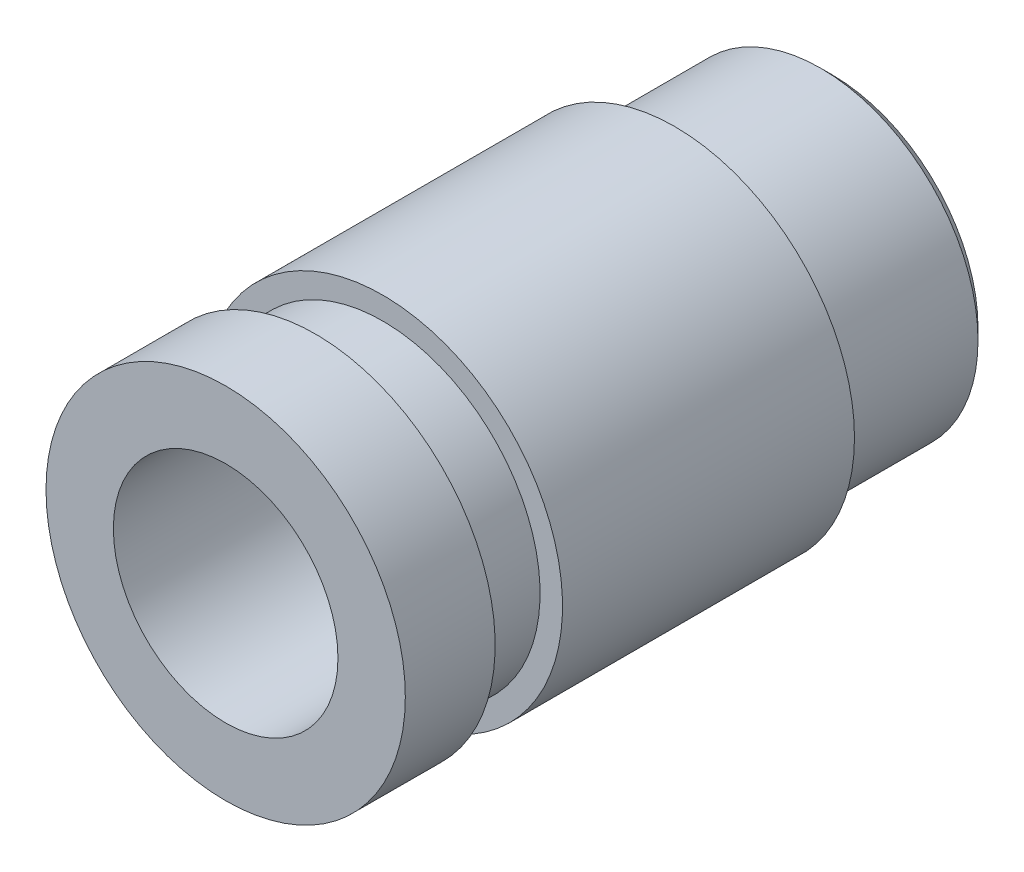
ISO-10303-21;
HEADER;
FILE_DESCRIPTION(('STEP AP214'),'2;1');
FILE_NAME('part.step','',(''),(''),'','','');
FILE_SCHEMA(('AUTOMOTIVE_DESIGN { 1 0 10303 214 1 1 1 1 }'));
ENDSEC;
DATA;
#1=APPLICATION_CONTEXT('core data for automotive mechanical design processes');
#2=APPLICATION_PROTOCOL_DEFINITION('international standard','automotive_design',2000,#1);
#3=PRODUCT_CONTEXT('',#1,'mechanical');
#4=PRODUCT('Part','Part','',(#3));
#5=PRODUCT_RELATED_PRODUCT_CATEGORY('part','',(#4));
#6=PRODUCT_DEFINITION_FORMATION('','',#4);
#7=PRODUCT_DEFINITION_CONTEXT('part definition',#1,'design');
#8=PRODUCT_DEFINITION('design','',#6,#7);
#9=PRODUCT_DEFINITION_SHAPE('','',#8);
#10=(LENGTH_UNIT() NAMED_UNIT(*) SI_UNIT(.MILLI.,.METRE.));
#11=(NAMED_UNIT(*) PLANE_ANGLE_UNIT() SI_UNIT($,.RADIAN.));
#12=(NAMED_UNIT(*) SI_UNIT($,.STERADIAN.) SOLID_ANGLE_UNIT());
#13=UNCERTAINTY_MEASURE_WITH_UNIT(LENGTH_MEASURE(1.E-05),#10,'distance_accuracy_value','');
#14=(GEOMETRIC_REPRESENTATION_CONTEXT(3) GLOBAL_UNCERTAINTY_ASSIGNED_CONTEXT((#13)) GLOBAL_UNIT_ASSIGNED_CONTEXT((#10,
#11,#12)) REPRESENTATION_CONTEXT('',''));
#15=CARTESIAN_POINT('',(0.,0.,0.));
#16=DIRECTION('',(0.,0.,1.));
#17=DIRECTION('',(1.,0.,0.));
#18=AXIS2_PLACEMENT_3D('',#15,#16,#17);
#19=CARTESIAN_POINT('',(0.,0.,10.));
#20=DIRECTION('',(0.,0.,-1.));
#21=DIRECTION('',(-1.,0.,0.));
#22=AXIS2_PLACEMENT_3D('',#19,#20,#21);
#23=CYLINDRICAL_SURFACE('',#22,4.);
#24=CARTESIAN_POINT('',(0.,0.,8.));
#25=DIRECTION('',(0.,0.,-1.));
#26=DIRECTION('',(-1.,0.,0.));
#27=AXIS2_PLACEMENT_3D('',#24,#25,#26);
#28=CIRCLE('',#27,4.);
#29=CARTESIAN_POINT('',(-4.,0.,8.));
#30=VERTEX_POINT('',#29);
#31=EDGE_CURVE('E69',#30,#30,#28,.T.);
#32=ORIENTED_EDGE('',*,*,#31,.F.);
#33=EDGE_LOOP('',(#32));
#34=FACE_BOUND('',#33,.T.);
#35=CARTESIAN_POINT('',(0.,0.,10.));
#36=DIRECTION('',(0.,0.,1.));
#37=DIRECTION('',(1.,0.,0.));
#38=AXIS2_PLACEMENT_3D('',#35,#36,#37);
#39=CIRCLE('',#38,4.);
#40=CARTESIAN_POINT('',(4.,0.,10.));
#41=VERTEX_POINT('',#40);
#42=EDGE_CURVE('E46',#41,#41,#39,.T.);
#43=ORIENTED_EDGE('',*,*,#42,.F.);
#44=EDGE_LOOP('',(#43));
#45=FACE_BOUND('',#44,.T.);
#46=ADVANCED_FACE('F31',(#34,#45),#23,.T.);
#47=CARTESIAN_POINT('',(0.,0.,6.5));
#48=DIRECTION('',(0.,0.,-1.));
#49=DIRECTION('',(-1.,0.,0.));
#50=AXIS2_PLACEMENT_3D('',#47,#48,#49);
#51=CIRCLE('',#50,4.);
#52=CARTESIAN_POINT('',(-4.,0.,6.5));
#53=VERTEX_POINT('',#52);
#54=EDGE_CURVE('E66',#53,#53,#51,.T.);
#55=ORIENTED_EDGE('',*,*,#54,.T.);
#56=EDGE_LOOP('',(#55));
#57=FACE_BOUND('',#56,.T.);
#58=CARTESIAN_POINT('',(0.,0.,0.));
#59=DIRECTION('',(0.,0.,1.));
#60=DIRECTION('',(1.,0.,0.));
#61=AXIS2_PLACEMENT_3D('',#58,#59,#60);
#62=CIRCLE('',#61,4.);
#63=CARTESIAN_POINT('',(4.,0.,0.));
#64=VERTEX_POINT('',#63);
#65=EDGE_CURVE('E49',#64,#64,#62,.T.);
#66=ORIENTED_EDGE('',*,*,#65,.T.);
#67=EDGE_LOOP('',(#66));
#68=FACE_BOUND('',#67,.T.);
#69=ADVANCED_FACE('F77',(#57,#68),#23,.T.);
#70=CARTESIAN_POINT('',(0.,0.,10.));
#71=DIRECTION('',(0.,0.,1.));
#72=DIRECTION('',(1.,0.,0.));
#73=AXIS2_PLACEMENT_3D('',#70,#71,#72);
#74=PLANE('',#73);
#75=CARTESIAN_POINT('',(0.,0.,10.));
#76=DIRECTION('',(0.,0.,1.));
#77=DIRECTION('',(1.,0.,0.));
#78=AXIS2_PLACEMENT_3D('',#75,#76,#77);
#79=CIRCLE('',#78,2.5);
#80=CARTESIAN_POINT('',(-2.5,0.,10.));
#81=VERTEX_POINT('',#80);
#82=EDGE_CURVE('E55',#81,#81,#79,.F.);
#83=ORIENTED_EDGE('',*,*,#82,.T.);
#84=EDGE_LOOP('',(#83));
#85=FACE_BOUND('',#84,.T.);
#86=ORIENTED_EDGE('',*,*,#42,.T.);
#87=EDGE_LOOP('',(#86));
#88=FACE_BOUND('',#87,.T.);
#89=ADVANCED_FACE('F80',(#85,#88),#74,.T.);
#90=CARTESIAN_POINT('',(0.,0.,0.));
#91=DIRECTION('',(0.,0.,1.));
#92=DIRECTION('',(1.,0.,0.));
#93=AXIS2_PLACEMENT_3D('',#90,#91,#92);
#94=PLANE('',#93);
#95=CARTESIAN_POINT('',(0.,0.,0.));
#96=DIRECTION('',(0.,0.,1.));
#97=DIRECTION('',(1.,0.,0.));
#98=AXIS2_PLACEMENT_3D('',#95,#96,#97);
#99=CIRCLE('',#98,3.5);
#100=CARTESIAN_POINT('',(3.5,0.,0.));
#101=VERTEX_POINT('',#100);
#102=EDGE_CURVE('E42',#101,#101,#99,.F.);
#103=ORIENTED_EDGE('',*,*,#102,.F.);
#104=EDGE_LOOP('',(#103));
#105=FACE_BOUND('',#104,.T.);
#106=ORIENTED_EDGE('',*,*,#65,.F.);
#107=EDGE_LOOP('',(#106));
#108=FACE_BOUND('',#107,.T.);
#109=ADVANCED_FACE('F82',(#105,#108),#94,.F.);
#110=CARTESIAN_POINT('',(0.,0.,-3.5));
#111=DIRECTION('',(0.,0.,1.));
#112=DIRECTION('',(1.,0.,0.));
#113=AXIS2_PLACEMENT_3D('',#110,#111,#112);
#114=CYLINDRICAL_SURFACE('',#113,3.5);
#115=CARTESIAN_POINT('',(0.,0.,-3.25));
#116=DIRECTION('',(0.,0.,-1.));
#117=DIRECTION('',(-1.,0.,0.));
#118=AXIS2_PLACEMENT_3D('',#115,#116,#117);
#119=CIRCLE('',#118,3.5);
#120=CARTESIAN_POINT('',(-3.5,0.,-3.25));
#121=VERTEX_POINT('',#120);
#122=EDGE_CURVE('E10',#121,#121,#119,.F.);
#123=ORIENTED_EDGE('',*,*,#122,.T.);
#124=EDGE_LOOP('',(#123));
#125=FACE_BOUND('',#124,.T.);
#126=ORIENTED_EDGE('',*,*,#102,.T.);
#127=EDGE_LOOP('',(#126));
#128=FACE_BOUND('',#127,.T.);
#129=ADVANCED_FACE('F89',(#125,#128),#114,.T.);
#130=CARTESIAN_POINT('',(0.,0.,-3.5));
#131=DIRECTION('',(0.,0.,-1.));
#132=DIRECTION('',(-1.,0.,0.));
#133=AXIS2_PLACEMENT_3D('',#130,#131,#132);
#134=PLANE('',#133);
#135=CARTESIAN_POINT('',(0.,0.,-3.5));
#136=DIRECTION('',(0.,0.,-1.));
#137=DIRECTION('',(-1.,0.,0.));
#138=AXIS2_PLACEMENT_3D('',#135,#136,#137);
#139=CIRCLE('',#138,2.5);
#140=CARTESIAN_POINT('',(-2.5,0.,-3.5));
#141=VERTEX_POINT('',#140);
#142=EDGE_CURVE('E52',#141,#141,#139,.T.);
#143=ORIENTED_EDGE('',*,*,#142,.F.);
#144=EDGE_LOOP('',(#143));
#145=FACE_BOUND('',#144,.T.);
#146=CARTESIAN_POINT('',(0.,0.,-3.5));
#147=DIRECTION('',(0.,0.,-1.));
#148=DIRECTION('',(-1.,0.,0.));
#149=AXIS2_PLACEMENT_3D('',#146,#147,#148);
#150=CIRCLE('',#149,3.25);
#151=CARTESIAN_POINT('',(-3.25,0.,-3.5));
#152=VERTEX_POINT('',#151);
#153=EDGE_CURVE('E38',#152,#152,#150,.T.);
#154=ORIENTED_EDGE('',*,*,#153,.T.);
#155=EDGE_LOOP('',(#154));
#156=FACE_BOUND('',#155,.T.);
#157=ADVANCED_FACE('F96',(#145,#156),#134,.T.);
#158=CARTESIAN_POINT('',(0.,0.,-3.5));
#159=DIRECTION('',(0.,0.,1.));
#160=DIRECTION('',(1.,0.,0.));
#161=AXIS2_PLACEMENT_3D('',#158,#159,#160);
#162=CONICAL_SURFACE('',#161,3.25,0.785398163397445);
#163=ORIENTED_EDGE('',*,*,#122,.F.);
#164=EDGE_LOOP('',(#163));
#165=FACE_BOUND('',#164,.T.);
#166=ORIENTED_EDGE('',*,*,#153,.F.);
#167=EDGE_LOOP('',(#166));
#168=FACE_BOUND('',#167,.T.);
#169=ADVANCED_FACE('F33',(#165,#168),#162,.T.);
#170=CARTESIAN_POINT('',(0.,0.,10.001));
#171=DIRECTION('',(0.,0.,-1.));
#172=DIRECTION('',(-1.,0.,0.));
#173=AXIS2_PLACEMENT_3D('',#170,#171,#172);
#174=CYLINDRICAL_SURFACE('',#173,2.5);
#175=CARTESIAN_POINT('',(-2.5,0.,10.));
#176=CARTESIAN_POINT('',(-2.5,0.,9.859375));
#177=CARTESIAN_POINT('',(-2.5,0.,9.71875));
#178=CARTESIAN_POINT('',(-2.5,0.,9.4375));
#179=CARTESIAN_POINT('',(-2.5,0.,9.296875));
#180=CARTESIAN_POINT('',(-2.5,0.,9.015625));
#181=CARTESIAN_POINT('',(-2.5,0.,8.875));
#182=CARTESIAN_POINT('',(-2.5,0.,8.59375));
#183=CARTESIAN_POINT('',(-2.5,0.,8.453125));
#184=CARTESIAN_POINT('',(-2.5,0.,8.171875));
#185=CARTESIAN_POINT('',(-2.5,0.,8.03125));
#186=CARTESIAN_POINT('',(-2.5,0.,7.75));
#187=CARTESIAN_POINT('',(-2.5,0.,7.609375));
#188=CARTESIAN_POINT('',(-2.5,0.,7.328125));
#189=CARTESIAN_POINT('',(-2.5,0.,7.1875));
#190=CARTESIAN_POINT('',(-2.5,0.,6.90625));
#191=CARTESIAN_POINT('',(-2.5,0.,6.765625));
#192=CARTESIAN_POINT('',(-2.5,0.,6.484375));
#193=CARTESIAN_POINT('',(-2.5,0.,6.34375));
#194=CARTESIAN_POINT('',(-2.5,0.,6.0625));
#195=CARTESIAN_POINT('',(-2.5,0.,5.921875));
#196=CARTESIAN_POINT('',(-2.5,0.,5.640625));
#197=CARTESIAN_POINT('',(-2.5,0.,5.5));
#198=CARTESIAN_POINT('',(-2.5,0.,5.21875));
#199=CARTESIAN_POINT('',(-2.5,0.,5.078125));
#200=CARTESIAN_POINT('',(-2.5,0.,4.796875));
#201=CARTESIAN_POINT('',(-2.5,0.,4.65625));
#202=CARTESIAN_POINT('',(-2.5,0.,4.375));
#203=CARTESIAN_POINT('',(-2.5,0.,4.234375));
#204=CARTESIAN_POINT('',(-2.5,0.,3.953125));
#205=CARTESIAN_POINT('',(-2.5,0.,3.8125));
#206=CARTESIAN_POINT('',(-2.5,0.,3.53125));
#207=CARTESIAN_POINT('',(-2.5,0.,3.390625));
#208=CARTESIAN_POINT('',(-2.5,0.,3.109375));
#209=CARTESIAN_POINT('',(-2.5,0.,2.96875));
#210=CARTESIAN_POINT('',(-2.5,0.,2.6875));
#211=CARTESIAN_POINT('',(-2.5,0.,2.546875));
#212=CARTESIAN_POINT('',(-2.5,0.,2.265625));
#213=CARTESIAN_POINT('',(-2.5,0.,2.125));
#214=CARTESIAN_POINT('',(-2.5,0.,1.84375));
#215=CARTESIAN_POINT('',(-2.5,0.,1.703125));
#216=CARTESIAN_POINT('',(-2.5,0.,1.421875));
#217=CARTESIAN_POINT('',(-2.5,0.,1.28125));
#218=CARTESIAN_POINT('',(-2.5,0.,1.));
#219=CARTESIAN_POINT('',(-2.5,0.,0.859375));
#220=CARTESIAN_POINT('',(-2.5,0.,0.578124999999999));
#221=CARTESIAN_POINT('',(-2.5,0.,0.4375));
#222=CARTESIAN_POINT('',(-2.5,0.,0.15625));
#223=CARTESIAN_POINT('',(-2.5,0.,0.0156249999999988));
#224=CARTESIAN_POINT('',(-2.5,0.,-0.265625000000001));
#225=CARTESIAN_POINT('',(-2.5,0.,-0.406250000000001));
#226=CARTESIAN_POINT('',(-2.5,0.,-0.6875));
#227=CARTESIAN_POINT('',(-2.5,0.,-0.828125));
#228=CARTESIAN_POINT('',(-2.5,0.,-1.109375));
#229=CARTESIAN_POINT('',(-2.5,0.,-1.25));
#230=CARTESIAN_POINT('',(-2.5,0.,-1.53125));
#231=CARTESIAN_POINT('',(-2.5,0.,-1.671875));
#232=CARTESIAN_POINT('',(-2.5,0.,-1.953125));
#233=CARTESIAN_POINT('',(-2.5,0.,-2.09375));
#234=CARTESIAN_POINT('',(-2.5,0.,-2.375));
#235=CARTESIAN_POINT('',(-2.5,0.,-2.515625));
#236=CARTESIAN_POINT('',(-2.5,0.,-2.796875));
#237=CARTESIAN_POINT('',(-2.5,0.,-2.9375));
#238=CARTESIAN_POINT('',(-2.5,0.,-3.21875));
#239=CARTESIAN_POINT('',(-2.5,0.,-3.359375));
#240=CARTESIAN_POINT('',(-2.5,0.,-3.5));
#241=B_SPLINE_CURVE_WITH_KNOTS('',3,(#175,#176,#177,#178,#179,#180,#181,#182,#183,#184,#185,
#186,#187,#188,#189,#190,#191,#192,#193,#194,#195,#196,#197,#198,#199,#200,#201,#202,#203,#204,
#205,#206,#207,#208,#209,#210,#211,#212,#213,#214,#215,#216,#217,#218,#219,#220,#221,#222,#223,
#224,#225,#226,#227,#228,#229,#230,#231,#232,#233,#234,#235,#236,#237,#238,#239,#240),
.UNSPECIFIED.,.F.,.F.,(4,2,2,2,2,2,2,2,2,2,2,2,2,2,2,2,2,2,2,2,2,2,2,2,2,2,2,2,2,2,2,2,4),(0.,
0.421875,0.843750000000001,1.265625,1.6875,2.109375,2.53125,2.953125,3.375,3.796875,4.21875,
4.640625,5.0625,5.484375,5.90625,6.328125,6.75,7.171875,7.59375,8.015625,8.4375,8.859375,
9.28125,9.703125,10.125,10.546875,10.96875,11.390625,11.8125,12.234375,12.65625,13.078125,13.5),.UNSPECIFIED.);
#242=EDGE_CURVE('BSEAM100',#81,#141,#241,.T.);
#243=ORIENTED_EDGE('',*,*,#82,.F.);
#244=ORIENTED_EDGE('',*,*,#142,.T.);
#245=ORIENTED_EDGE('',*,*,#242,.T.);
#246=ORIENTED_EDGE('',*,*,#242,.F.);
#247=EDGE_LOOP('',(#243,#245,#244,#246));
#248=FACE_BOUND('',#247,.T.);
#249=ADVANCED_FACE('F100',(#248),#174,.F.);
#250=CARTESIAN_POINT('',(0.,4.,8.));
#251=DIRECTION('',(0.,0.,1.));
#252=DIRECTION('',(1.,0.,0.));
#253=AXIS2_PLACEMENT_3D('',#250,#251,#252);
#254=PLANE('',#253);
#255=CARTESIAN_POINT('',(0.,0.,8.));
#256=DIRECTION('',(0.,0.,-1.));
#257=DIRECTION('',(-1.,0.,0.));
#258=AXIS2_PLACEMENT_3D('',#255,#256,#257);
#259=CIRCLE('',#258,3.5);
#260=CARTESIAN_POINT('',(-3.5,0.,8.));
#261=VERTEX_POINT('',#260);
#262=EDGE_CURVE('E58',#261,#261,#259,.T.);
#263=ORIENTED_EDGE('',*,*,#262,.F.);
#264=EDGE_LOOP('',(#263));
#265=FACE_BOUND('',#264,.T.);
#266=ORIENTED_EDGE('',*,*,#31,.T.);
#267=EDGE_LOOP('',(#266));
#268=FACE_BOUND('',#267,.T.);
#269=ADVANCED_FACE('F73',(#265,#268),#254,.F.);
#270=CARTESIAN_POINT('',(0.,0.,0.));
#271=DIRECTION('',(0.,0.,-1.));
#272=DIRECTION('',(-1.,0.,0.));
#273=AXIS2_PLACEMENT_3D('',#270,#271,#272);
#274=CYLINDRICAL_SURFACE('',#273,3.5);
#275=CARTESIAN_POINT('',(0.,0.,6.5));
#276=DIRECTION('',(0.,0.,-1.));
#277=DIRECTION('',(-1.,0.,0.));
#278=AXIS2_PLACEMENT_3D('',#275,#276,#277);
#279=CIRCLE('',#278,3.5);
#280=CARTESIAN_POINT('',(-3.5,0.,6.5));
#281=VERTEX_POINT('',#280);
#282=EDGE_CURVE('E63',#281,#281,#279,.T.);
#283=ORIENTED_EDGE('',*,*,#282,.F.);
#284=EDGE_LOOP('',(#283));
#285=FACE_BOUND('',#284,.T.);
#286=ORIENTED_EDGE('',*,*,#262,.T.);
#287=EDGE_LOOP('',(#286));
#288=FACE_BOUND('',#287,.T.);
#289=ADVANCED_FACE('F106',(#285,#288),#274,.T.);
#290=CARTESIAN_POINT('',(0.,4.,6.5));
#291=DIRECTION('',(0.,0.,-1.));
#292=DIRECTION('',(-1.,0.,0.));
#293=AXIS2_PLACEMENT_3D('',#290,#291,#292);
#294=PLANE('',#293);
#295=ORIENTED_EDGE('',*,*,#54,.F.);
#296=EDGE_LOOP('',(#295));
#297=FACE_BOUND('',#296,.T.);
#298=ORIENTED_EDGE('',*,*,#282,.T.);
#299=EDGE_LOOP('',(#298));
#300=FACE_BOUND('',#299,.T.);
#301=ADVANCED_FACE('F110',(#297,#300),#294,.F.);
#302=CLOSED_SHELL('',(#46,#69,#89,#109,#129,#157,#169,#249,#269,#289,#301));
#303=MANIFOLD_SOLID_BREP('B2',#302);
#304=ADVANCED_BREP_SHAPE_REPRESENTATION('',(#18,#303),#14);
#305=SHAPE_DEFINITION_REPRESENTATION(#9,#304);
ENDSEC;
END-ISO-10303-21;
